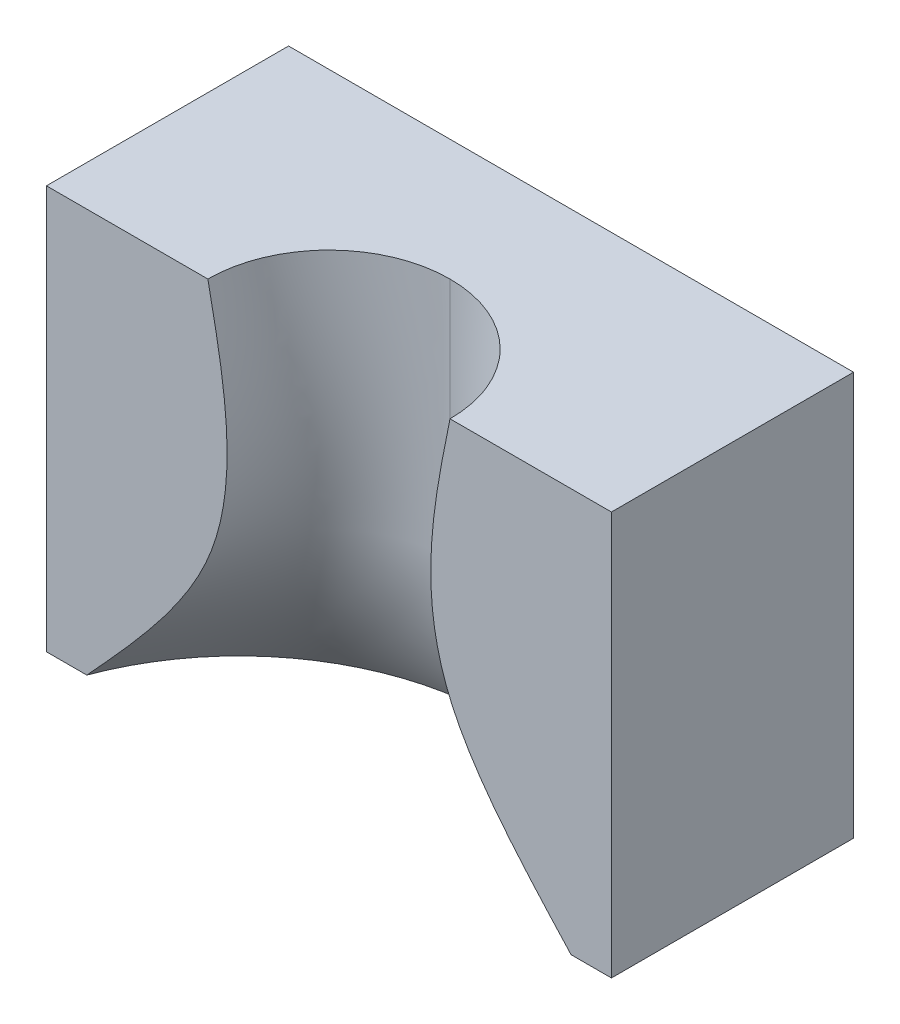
ISO-10303-21;
HEADER;
FILE_DESCRIPTION(('STEP AP214'),'2;1');
FILE_NAME('part.step','',(''),(''),'','','');
FILE_SCHEMA(('AUTOMOTIVE_DESIGN { 1 0 10303 214 1 1 1 1 }'));
ENDSEC;
DATA;
#1=APPLICATION_CONTEXT('core data for automotive mechanical design processes');
#2=APPLICATION_PROTOCOL_DEFINITION('international standard','automotive_design',2000,#1);
#3=PRODUCT_CONTEXT('',#1,'mechanical');
#4=PRODUCT('Part','Part','',(#3));
#5=PRODUCT_RELATED_PRODUCT_CATEGORY('part','',(#4));
#6=PRODUCT_DEFINITION_FORMATION('','',#4);
#7=PRODUCT_DEFINITION_CONTEXT('part definition',#1,'design');
#8=PRODUCT_DEFINITION('design','',#6,#7);
#9=PRODUCT_DEFINITION_SHAPE('','',#8);
#10=(LENGTH_UNIT() NAMED_UNIT(*) SI_UNIT(.MILLI.,.METRE.));
#11=(NAMED_UNIT(*) PLANE_ANGLE_UNIT() SI_UNIT($,.RADIAN.));
#12=(NAMED_UNIT(*) SI_UNIT($,.STERADIAN.) SOLID_ANGLE_UNIT());
#13=UNCERTAINTY_MEASURE_WITH_UNIT(LENGTH_MEASURE(1.E-05),#10,'distance_accuracy_value','');
#14=(GEOMETRIC_REPRESENTATION_CONTEXT(3) GLOBAL_UNCERTAINTY_ASSIGNED_CONTEXT((#13)) GLOBAL_UNIT_ASSIGNED_CONTEXT((#10,
#11,#12)) REPRESENTATION_CONTEXT('',''));
#15=CARTESIAN_POINT('',(0.,0.,0.));
#16=DIRECTION('',(0.,0.,1.));
#17=DIRECTION('',(1.,0.,0.));
#18=AXIS2_PLACEMENT_3D('',#15,#16,#17);
#19=CARTESIAN_POINT('',(-35.,50.,15.));
#20=DIRECTION('',(0.,0.,-1.));
#21=DIRECTION('',(-1.,0.,0.));
#22=AXIS2_PLACEMENT_3D('',#19,#20,#21);
#23=PLANE('',#22);
#24=DIRECTION('',(1.,0.,0.));
#25=VECTOR('',#24,1.);
#26=CARTESIAN_POINT('',(-35.,0.,15.));
#27=LINE('',#26,#25);
#28=CARTESIAN_POINT('',(-35.,0.,15.));
#29=VERTEX_POINT('',#28);
#30=CARTESIAN_POINT('',(-30.,0.,15.));
#31=VERTEX_POINT('',#30);
#32=EDGE_CURVE('E254',#29,#31,#27,.T.);
#33=ORIENTED_EDGE('',*,*,#32,.T.);
#34=CARTESIAN_POINT('',(-15.,50.,15.));
#35=CARTESIAN_POINT('',(-12.9368855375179,39.8251878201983,15.));
#36=CARTESIAN_POINT('',(-10.8737710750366,29.6503756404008,15.));
#37=CARTESIAN_POINT('',(-17.9256314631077,13.1575675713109,15.));
#38=CARTESIAN_POINT('',(-23.9628157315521,6.57878378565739,15.));
#39=CARTESIAN_POINT('',(-30.,0.,15.));
#40=B_SPLINE_CURVE_WITH_KNOTS('',3,(#34,#35,#36,#37,#38,#39),.UNSPECIFIED.,.F.,.F.,(4,2,4),(0.,
0.585126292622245,1.),.UNSPECIFIED.);
#41=CARTESIAN_POINT('',(-15.,50.,15.));
#42=VERTEX_POINT('',#41);
#43=EDGE_CURVE('E248',#42,#31,#40,.T.);
#44=ORIENTED_EDGE('',*,*,#43,.F.);
#45=DIRECTION('',(1.,0.,0.));
#46=VECTOR('',#45,1.);
#47=CARTESIAN_POINT('',(-35.,50.,15.));
#48=LINE('',#47,#46);
#49=CARTESIAN_POINT('',(-35.,50.,15.));
#50=VERTEX_POINT('',#49);
#51=EDGE_CURVE('E281',#50,#42,#48,.T.);
#52=ORIENTED_EDGE('',*,*,#51,.F.);
#53=DIRECTION('',(0.,-1.,0.));
#54=VECTOR('',#53,1.);
#55=CARTESIAN_POINT('',(-35.,50.,15.));
#56=LINE('',#55,#54);
#57=EDGE_CURVE('E13',#50,#29,#56,.T.);
#58=ORIENTED_EDGE('',*,*,#57,.T.);
#59=EDGE_LOOP('',(#33,#44,#52,#58));
#60=FACE_BOUND('',#59,.T.);
#61=ADVANCED_FACE('F167',(#60),#23,.F.);
#62=CARTESIAN_POINT('',(-35.,50.,-15.));
#63=DIRECTION('',(1.,0.,0.));
#64=DIRECTION('',(0.,0.,-1.));
#65=AXIS2_PLACEMENT_3D('',#62,#63,#64);
#66=PLANE('',#65);
#67=DIRECTION('',(0.,0.,1.));
#68=VECTOR('',#67,1.);
#69=CARTESIAN_POINT('',(-35.,0.,-15.));
#70=LINE('',#69,#68);
#71=CARTESIAN_POINT('',(-35.,0.,-15.));
#72=VERTEX_POINT('',#71);
#73=EDGE_CURVE('E255',#72,#29,#70,.T.);
#74=ORIENTED_EDGE('',*,*,#73,.T.);
#75=ORIENTED_EDGE('',*,*,#57,.F.);
#76=DIRECTION('',(0.,0.,1.));
#77=VECTOR('',#76,1.);
#78=CARTESIAN_POINT('',(-35.,50.,-15.));
#79=LINE('',#78,#77);
#80=CARTESIAN_POINT('',(-35.,50.,-15.));
#81=VERTEX_POINT('',#80);
#82=EDGE_CURVE('E271',#81,#50,#79,.T.);
#83=ORIENTED_EDGE('',*,*,#82,.F.);
#84=DIRECTION('',(0.,-1.,0.));
#85=VECTOR('',#84,1.);
#86=CARTESIAN_POINT('',(-35.,50.,-15.));
#87=LINE('',#86,#85);
#88=EDGE_CURVE('E410',#81,#72,#87,.T.);
#89=ORIENTED_EDGE('',*,*,#88,.T.);
#90=EDGE_LOOP('',(#74,#75,#83,#89));
#91=FACE_BOUND('',#90,.T.);
#92=ADVANCED_FACE('F169',(#91),#66,.F.);
#93=CARTESIAN_POINT('',(15.,50.,15.));
#94=VERTEX_POINT('',#93);
#95=CARTESIAN_POINT('',(35.,50.,15.));
#96=VERTEX_POINT('',#95);
#97=EDGE_CURVE('E247',#94,#96,#48,.T.);
#98=ORIENTED_EDGE('',*,*,#97,.F.);
#99=CARTESIAN_POINT('',(15.,50.,15.));
#100=CARTESIAN_POINT('',(12.9368855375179,39.8251878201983,15.));
#101=CARTESIAN_POINT('',(10.8737710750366,29.6503756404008,15.));
#102=CARTESIAN_POINT('',(17.9256314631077,13.1575675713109,15.));
#103=CARTESIAN_POINT('',(23.9628157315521,6.57878378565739,15.));
#104=CARTESIAN_POINT('',(30.,0.,15.));
#105=B_SPLINE_CURVE_WITH_KNOTS('',3,(#99,#100,#101,#102,#103,#104),.UNSPECIFIED.,.F.,.F.,(4,2,
4),(0.,0.585126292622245,1.),.UNSPECIFIED.);
#106=CARTESIAN_POINT('',(30.,0.,15.));
#107=VERTEX_POINT('',#106);
#108=EDGE_CURVE('E232',#94,#107,#105,.T.);
#109=ORIENTED_EDGE('',*,*,#108,.T.);
#110=CARTESIAN_POINT('',(35.,0.,15.));
#111=VERTEX_POINT('',#110);
#112=EDGE_CURVE('E245',#107,#111,#27,.T.);
#113=ORIENTED_EDGE('',*,*,#112,.T.);
#114=DIRECTION('',(0.,-1.,0.));
#115=VECTOR('',#114,1.);
#116=CARTESIAN_POINT('',(35.,50.,15.));
#117=LINE('',#116,#115);
#118=EDGE_CURVE('E177',#96,#111,#117,.T.);
#119=ORIENTED_EDGE('',*,*,#118,.F.);
#120=EDGE_LOOP('',(#98,#109,#113,#119));
#121=FACE_BOUND('',#120,.T.);
#122=ADVANCED_FACE('F243',(#121),#23,.F.);
#123=CARTESIAN_POINT('',(35.,50.,-15.));
#124=DIRECTION('',(-1.,0.,0.));
#125=DIRECTION('',(0.,0.,1.));
#126=AXIS2_PLACEMENT_3D('',#123,#124,#125);
#127=PLANE('',#126);
#128=DIRECTION('',(0.,0.,-1.));
#129=VECTOR('',#128,1.);
#130=CARTESIAN_POINT('',(35.,0.,-15.));
#131=LINE('',#130,#129);
#132=CARTESIAN_POINT('',(35.,0.,-15.));
#133=VERTEX_POINT('',#132);
#134=EDGE_CURVE('E253',#111,#133,#131,.T.);
#135=ORIENTED_EDGE('',*,*,#134,.T.);
#136=DIRECTION('',(0.,-1.,0.));
#137=VECTOR('',#136,1.);
#138=CARTESIAN_POINT('',(35.,50.,-15.));
#139=LINE('',#138,#137);
#140=CARTESIAN_POINT('',(35.,50.,-15.));
#141=VERTEX_POINT('',#140);
#142=EDGE_CURVE('E414',#141,#133,#139,.T.);
#143=ORIENTED_EDGE('',*,*,#142,.F.);
#144=DIRECTION('',(0.,0.,-1.));
#145=VECTOR('',#144,1.);
#146=CARTESIAN_POINT('',(35.,50.,-15.));
#147=LINE('',#146,#145);
#148=EDGE_CURVE('E275',#96,#141,#147,.T.);
#149=ORIENTED_EDGE('',*,*,#148,.F.);
#150=ORIENTED_EDGE('',*,*,#118,.T.);
#151=EDGE_LOOP('',(#135,#143,#149,#150));
#152=FACE_BOUND('',#151,.T.);
#153=ADVANCED_FACE('F420',(#152),#127,.F.);
#154=CARTESIAN_POINT('',(-35.,50.,-15.));
#155=DIRECTION('',(0.,0.,1.));
#156=DIRECTION('',(1.,0.,0.));
#157=AXIS2_PLACEMENT_3D('',#154,#155,#156);
#158=PLANE('',#157);
#159=DIRECTION('',(-1.,0.,0.));
#160=VECTOR('',#159,1.);
#161=CARTESIAN_POINT('',(-35.,0.,-15.));
#162=LINE('',#161,#160);
#163=EDGE_CURVE('E269',#133,#72,#162,.T.);
#164=ORIENTED_EDGE('',*,*,#163,.T.);
#165=ORIENTED_EDGE('',*,*,#88,.F.);
#166=DIRECTION('',(-1.,0.,0.));
#167=VECTOR('',#166,1.);
#168=CARTESIAN_POINT('',(-35.,50.,-15.));
#169=LINE('',#168,#167);
#170=EDGE_CURVE('E193',#141,#81,#169,.T.);
#171=ORIENTED_EDGE('',*,*,#170,.F.);
#172=ORIENTED_EDGE('',*,*,#142,.T.);
#173=EDGE_LOOP('',(#164,#165,#171,#172));
#174=FACE_BOUND('',#173,.T.);
#175=ADVANCED_FACE('F314',(#174),#158,.F.);
#176=CARTESIAN_POINT('',(-35.,50.,15.));
#177=DIRECTION('',(0.,1.,0.));
#178=DIRECTION('',(0.,0.,1.));
#179=AXIS2_PLACEMENT_3D('',#176,#177,#178);
#180=PLANE('',#179);
#181=CARTESIAN_POINT('',(0.,50.,15.));
#182=DIRECTION('',(0.,1.,0.));
#183=DIRECTION('',(0.,0.,1.));
#184=AXIS2_PLACEMENT_3D('',#181,#182,#183);
#185=CIRCLE('',#184,15.);
#186=CARTESIAN_POINT('',(0.,50.,0.));
#187=VERTEX_POINT('',#186);
#188=EDGE_CURVE('E330',#187,#42,#185,.T.);
#189=ORIENTED_EDGE('',*,*,#188,.F.);
#190=EDGE_CURVE('E260',#94,#187,#185,.T.);
#191=ORIENTED_EDGE('',*,*,#190,.F.);
#192=ORIENTED_EDGE('',*,*,#97,.T.);
#193=ORIENTED_EDGE('',*,*,#148,.T.);
#194=ORIENTED_EDGE('',*,*,#170,.T.);
#195=ORIENTED_EDGE('',*,*,#82,.T.);
#196=ORIENTED_EDGE('',*,*,#51,.T.);
#197=EDGE_LOOP('',(#189,#191,#192,#193,#194,#195,#196));
#198=FACE_BOUND('',#197,.T.);
#199=ADVANCED_FACE('F298',(#198),#180,.T.);
#200=CARTESIAN_POINT('',(-35.,0.,15.));
#201=DIRECTION('',(0.,1.,0.));
#202=DIRECTION('',(0.,0.,1.));
#203=AXIS2_PLACEMENT_3D('',#200,#201,#202);
#204=PLANE('',#203);
#205=CARTESIAN_POINT('',(0.,0.,26.13552872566));
#206=DIRECTION('',(0.,-1.,0.));
#207=DIRECTION('',(0.,0.,-1.));
#208=AXIS2_PLACEMENT_3D('',#205,#206,#207);
#209=CIRCLE('',#208,32.);
#210=CARTESIAN_POINT('',(0.,0.,-5.86447127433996));
#211=VERTEX_POINT('',#210);
#212=EDGE_CURVE('E228',#211,#107,#209,.T.);
#213=ORIENTED_EDGE('',*,*,#212,.F.);
#214=EDGE_CURVE('E171',#31,#211,#209,.T.);
#215=ORIENTED_EDGE('',*,*,#214,.F.);
#216=ORIENTED_EDGE('',*,*,#32,.F.);
#217=ORIENTED_EDGE('',*,*,#73,.F.);
#218=ORIENTED_EDGE('',*,*,#163,.F.);
#219=ORIENTED_EDGE('',*,*,#134,.F.);
#220=ORIENTED_EDGE('',*,*,#112,.F.);
#221=EDGE_LOOP('',(#213,#215,#216,#217,#218,#219,#220));
#222=FACE_BOUND('',#221,.T.);
#223=ADVANCED_FACE('F251',(#222),#204,.F.);
#224=CARTESIAN_POINT('',(-15.,50.,15.));
#225=CARTESIAN_POINT('',(-12.9368855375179,39.8251878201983,15.));
#226=CARTESIAN_POINT('',(-10.8737710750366,29.6503756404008,15.));
#227=CARTESIAN_POINT('',(-17.9256314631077,13.1575675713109,15.));
#228=CARTESIAN_POINT('',(-23.9628157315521,6.57878378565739,15.));
#229=CARTESIAN_POINT('',(-30.,0.,15.));
#230=CARTESIAN_POINT('',(-15.,50.,13.1074026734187));
#231=CARTESIAN_POINT('',(-13.1041316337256,39.8251878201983,13.2976672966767));
#232=CARTESIAN_POINT('',(-11.2082632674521,29.6503756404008,13.4879319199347));
#233=CARTESIAN_POINT('',(-17.6884655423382,13.1575675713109,12.8375949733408));
#234=CARTESIAN_POINT('',(-23.2362462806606,6.57878378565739,12.2808335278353));
#235=CARTESIAN_POINT('',(-28.7840270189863,0.,11.7240720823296));
#236=CARTESIAN_POINT('',(-14.2730367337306,50.0000000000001,9.25222405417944));
#237=CARTESIAN_POINT('',(-12.7438516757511,39.8470393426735,9.6197923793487));
#238=CARTESIAN_POINT('',(-11.2146666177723,29.6940786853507,9.9873607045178));
#239=CARTESIAN_POINT('',(-16.4415213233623,13.1265806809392,8.73098808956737));
#240=CARTESIAN_POINT('',(-20.9162958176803,6.50238652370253,7.40094487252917));
#241=CARTESIAN_POINT('',(-25.391070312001,0.,5.84673713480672));
#242=CARTESIAN_POINT('',(-10.9780655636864,50.,4.19894032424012));
#243=CARTESIAN_POINT('',(-9.98059744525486,39.9125939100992,4.4747481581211));
#244=CARTESIAN_POINT('',(-8.9831293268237,29.8251878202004,4.75055599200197));
#245=CARTESIAN_POINT('',(-12.3925407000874,13.0336200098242,3.80782674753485));
#246=CARTESIAN_POINT('',(-15.3113796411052,6.27319473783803,1.98295588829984));
#247=CARTESIAN_POINT('',(-18.2302185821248,0.,-0.738573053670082));
#248=CARTESIAN_POINT('',(-5.92891869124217,50.,0.783874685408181));
#249=CARTESIAN_POINT('',(-5.42351371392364,39.9781484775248,0.857372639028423));
#250=CARTESIAN_POINT('',(-4.91810873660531,29.95629695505,0.930870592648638));
#251=CARTESIAN_POINT('',(-6.6456160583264,12.9406593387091,0.679649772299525));
#252=CARTESIAN_POINT('',(-8.12455628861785,6.04400295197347,-1.31655381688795));
#253=CARTESIAN_POINT('',(-9.60349651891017,0.,-4.88190905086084));
#254=CARTESIAN_POINT('',(-1.96349539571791,50.,0.));
#255=CARTESIAN_POINT('',(-1.78778613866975,40.,0.));
#256=CARTESIAN_POINT('',(-1.61207688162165,30.,0.));
#257=CARTESIAN_POINT('',(-2.21266263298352,12.9096724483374,0.));
#258=CARTESIAN_POINT('',(-2.72683146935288,5.96760569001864,-2.03557755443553));
#259=CARTESIAN_POINT('',(-3.24100030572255,0.,-5.86447127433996));
#260=CARTESIAN_POINT('',(0.,50.,0.));
#261=CARTESIAN_POINT('',(0.,40.,0.));
#262=CARTESIAN_POINT('',(0.,30.,0.));
#263=CARTESIAN_POINT('',(0.,12.9096724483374,0.));
#264=CARTESIAN_POINT('',(0.,5.96760569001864,-2.03557755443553));
#265=CARTESIAN_POINT('',(0.,0.,-5.86447127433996));
#266=B_SPLINE_SURFACE_WITH_KNOTS('',3,3,((#224,#225,#226,#227,#228,#229),(#230,#231,#232,#233,
#234,#235),(#236,#237,#238,#239,#240,#241),(#242,#243,#244,#245,#246,#247),(#248,#249,#250,#251,
#252,#253),(#254,#255,#256,#257,#258,#259),(#260,#261,#262,#263,#264,#265)),.UNSPECIFIED.,.F.,
.F.,.F.,(4,1,1,1,4),(4,2,4),(0.702238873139,0.77667915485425,0.8511194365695,0.92555971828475,
1.),(0.,0.585126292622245,1.),.UNSPECIFIED.);
#267=CARTESIAN_POINT('',(0.,50.,0.));
#268=CARTESIAN_POINT('',(0.,40.,0.));
#269=CARTESIAN_POINT('',(0.,30.,0.));
#270=CARTESIAN_POINT('',(0.,12.9096724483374,0.));
#271=CARTESIAN_POINT('',(0.,5.96760569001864,-2.03557755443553));
#272=CARTESIAN_POINT('',(0.,0.,-5.86447127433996));
#273=B_SPLINE_CURVE_WITH_KNOTS('',3,(#267,#268,#269,#270,#271,#272),.UNSPECIFIED.,.F.,.F.,(4,2,
4),(0.,0.585126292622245,1.),.UNSPECIFIED.);
#274=EDGE_CURVE('E185',#187,#211,#273,.T.);
#275=ORIENTED_EDGE('',*,*,#188,.T.);
#276=ORIENTED_EDGE('',*,*,#43,.T.);
#277=ORIENTED_EDGE('',*,*,#214,.T.);
#278=ORIENTED_EDGE('',*,*,#274,.F.);
#279=EDGE_LOOP('',(#275,#276,#277,#278));
#280=FACE_BOUND('',#279,.T.);
#281=ADVANCED_FACE('F297',(#280),#266,.F.);
#282=CARTESIAN_POINT('',(0.,50.,0.));
#283=CARTESIAN_POINT('',(0.,40.,0.));
#284=CARTESIAN_POINT('',(0.,30.,0.));
#285=CARTESIAN_POINT('',(0.,12.9096724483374,0.));
#286=CARTESIAN_POINT('',(0.,5.96760569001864,-2.03557755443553));
#287=CARTESIAN_POINT('',(0.,0.,-5.86447127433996));
#288=CARTESIAN_POINT('',(1.96349539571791,50.,0.));
#289=CARTESIAN_POINT('',(1.78778613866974,40.,0.));
#290=CARTESIAN_POINT('',(1.61207688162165,30.,0.));
#291=CARTESIAN_POINT('',(2.21266263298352,12.9096724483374,0.));
#292=CARTESIAN_POINT('',(2.72683146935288,5.96760569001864,-2.03557755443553));
#293=CARTESIAN_POINT('',(3.24100030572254,0.,-5.86447127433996));
#294=CARTESIAN_POINT('',(5.92891869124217,50.0000000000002,0.783874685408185));
#295=CARTESIAN_POINT('',(5.42351371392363,39.9781484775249,0.857372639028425));
#296=CARTESIAN_POINT('',(4.9181087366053,29.9562969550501,0.93087059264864));
#297=CARTESIAN_POINT('',(6.6456160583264,12.9406593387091,0.679649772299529));
#298=CARTESIAN_POINT('',(8.12455628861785,6.04400295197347,-1.31655381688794));
#299=CARTESIAN_POINT('',(9.60349651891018,0.,-4.88190905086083));
#300=CARTESIAN_POINT('',(10.9780655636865,49.9999999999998,4.19894032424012));
#301=CARTESIAN_POINT('',(9.9805974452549,39.9125939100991,4.47474815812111));
#302=CARTESIAN_POINT('',(8.98312932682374,29.8251878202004,4.75055599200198));
#303=CARTESIAN_POINT('',(12.3925407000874,13.0336200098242,3.80782674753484));
#304=CARTESIAN_POINT('',(15.3113796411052,6.27319473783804,1.98295588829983));
#305=CARTESIAN_POINT('',(18.2302185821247,0.,-0.738573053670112));
#306=CARTESIAN_POINT('',(14.2730367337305,50.0000000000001,9.25222405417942));
#307=CARTESIAN_POINT('',(12.743851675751,39.8470393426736,9.61979237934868));
#308=CARTESIAN_POINT('',(11.2146666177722,29.6940786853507,9.98736070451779));
#309=CARTESIAN_POINT('',(16.4415213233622,13.1265806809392,8.73098808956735));
#310=CARTESIAN_POINT('',(20.9162958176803,6.50238652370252,7.40094487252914));
#311=CARTESIAN_POINT('',(25.391070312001,0.,5.84673713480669));
#312=CARTESIAN_POINT('',(15.,50.,13.1074026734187));
#313=CARTESIAN_POINT('',(13.1041316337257,39.8251878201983,13.2976672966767));
#314=CARTESIAN_POINT('',(11.2082632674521,29.6503756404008,13.4879319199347));
#315=CARTESIAN_POINT('',(17.6884655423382,13.1575675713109,12.8375949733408));
#316=CARTESIAN_POINT('',(23.2362462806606,6.57878378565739,12.2808335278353));
#317=CARTESIAN_POINT('',(28.7840270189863,0.,11.7240720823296));
#318=CARTESIAN_POINT('',(15.,50.,15.));
#319=CARTESIAN_POINT('',(12.9368855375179,39.8251878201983,15.));
#320=CARTESIAN_POINT('',(10.8737710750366,29.6503756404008,15.));
#321=CARTESIAN_POINT('',(17.9256314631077,13.1575675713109,15.));
#322=CARTESIAN_POINT('',(23.9628157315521,6.57878378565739,15.));
#323=CARTESIAN_POINT('',(30.,0.,15.));
#324=B_SPLINE_SURFACE_WITH_KNOTS('',3,3,((#282,#283,#284,#285,#286,#287),(#288,#289,#290,#291,
#292,#293),(#294,#295,#296,#297,#298,#299),(#300,#301,#302,#303,#304,#305),(#306,#307,#308,#309,
#310,#311),(#312,#313,#314,#315,#316,#317),(#318,#319,#320,#321,#322,#323)),.UNSPECIFIED.,.F.,
.F.,.F.,(4,1,1,1,4),(4,2,4),(0.,0.07444028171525,0.1488805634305,0.22332084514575,
0.297761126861),(0.,0.585126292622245,1.),.UNSPECIFIED.);
#325=ORIENTED_EDGE('',*,*,#190,.T.);
#326=ORIENTED_EDGE('',*,*,#274,.T.);
#327=ORIENTED_EDGE('',*,*,#212,.T.);
#328=ORIENTED_EDGE('',*,*,#108,.F.);
#329=EDGE_LOOP('',(#325,#326,#327,#328));
#330=FACE_BOUND('',#329,.T.);
#331=ADVANCED_FACE('F231',(#330),#324,.F.);
#332=CLOSED_SHELL('',(#61,#92,#122,#153,#175,#199,#223,#281,#331));
#333=MANIFOLD_SOLID_BREP('B2',#332);
#334=ADVANCED_BREP_SHAPE_REPRESENTATION('',(#18,#333),#14);
#335=SHAPE_DEFINITION_REPRESENTATION(#9,#334);
ENDSEC;
END-ISO-10303-21;
